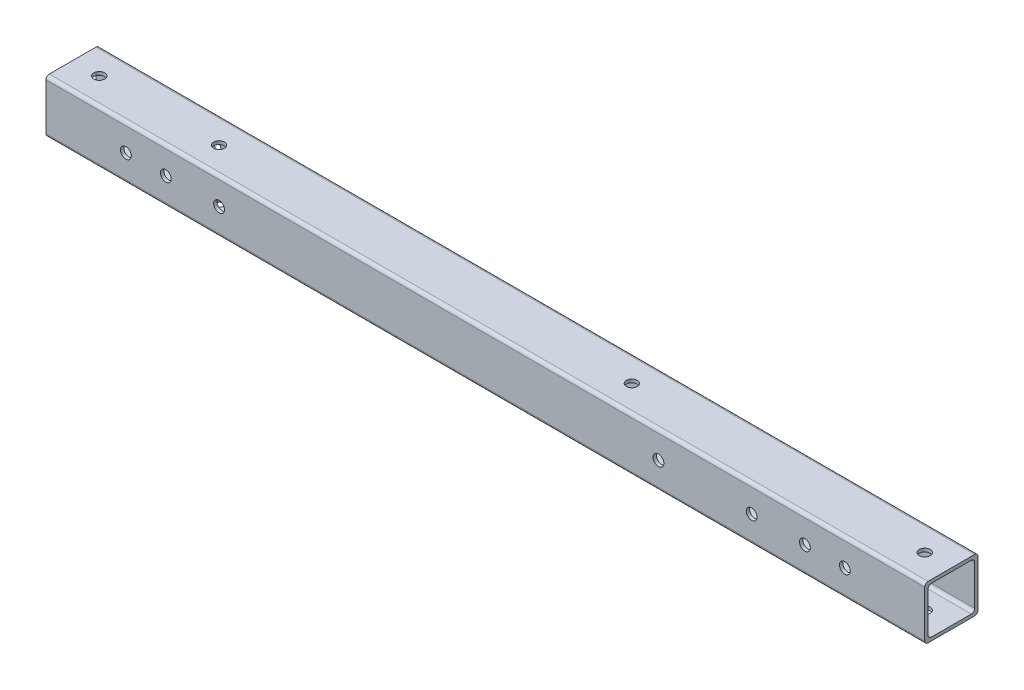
ISO-10303-21;
HEADER;
FILE_DESCRIPTION(('STEP AP214'),'2;1');
FILE_NAME('part.step','',(''),(''),'','','');
FILE_SCHEMA(('AUTOMOTIVE_DESIGN { 1 0 10303 214 1 1 1 1 }'));
ENDSEC;
DATA;
#1=APPLICATION_CONTEXT('core data for automotive mechanical design processes');
#2=APPLICATION_PROTOCOL_DEFINITION('international standard','automotive_design',2000,#1);
#3=PRODUCT_CONTEXT('',#1,'mechanical');
#4=PRODUCT('Part','Part','',(#3));
#5=PRODUCT_RELATED_PRODUCT_CATEGORY('part','',(#4));
#6=PRODUCT_DEFINITION_FORMATION('','',#4);
#7=PRODUCT_DEFINITION_CONTEXT('part definition',#1,'design');
#8=PRODUCT_DEFINITION('design','',#6,#7);
#9=PRODUCT_DEFINITION_SHAPE('','',#8);
#10=(LENGTH_UNIT() NAMED_UNIT(*) SI_UNIT(.MILLI.,.METRE.));
#11=(NAMED_UNIT(*) PLANE_ANGLE_UNIT() SI_UNIT($,.RADIAN.));
#12=(NAMED_UNIT(*) SI_UNIT($,.STERADIAN.) SOLID_ANGLE_UNIT());
#13=UNCERTAINTY_MEASURE_WITH_UNIT(LENGTH_MEASURE(1.E-05),#10,'distance_accuracy_value','');
#14=(GEOMETRIC_REPRESENTATION_CONTEXT(3) GLOBAL_UNCERTAINTY_ASSIGNED_CONTEXT((#13)) GLOBAL_UNIT_ASSIGNED_CONTEXT((#10,
#11,#12)) REPRESENTATION_CONTEXT('',''));
#15=CARTESIAN_POINT('',(0.,0.,0.));
#16=DIRECTION('',(0.,0.,1.));
#17=DIRECTION('',(1.,0.,0.));
#18=AXIS2_PLACEMENT_3D('',#15,#16,#17);
#19=CARTESIAN_POINT('',(0.,101.6,0.));
#20=DIRECTION('',(0.,0.,1.));
#21=DIRECTION('',(1.,0.,0.));
#22=AXIS2_PLACEMENT_3D('',#19,#20,#21);
#23=PLANE('',#22);
#24=CARTESIAN_POINT('',(-508.,50.8,0.));
#25=DIRECTION('',(0.,0.,-1.));
#26=DIRECTION('',(-1.,0.,0.));
#27=AXIS2_PLACEMENT_3D('',#24,#25,#26);
#28=CIRCLE('',#27,10.31875);
#29=CARTESIAN_POINT('',(-518.31875,50.8,0.));
#30=VERTEX_POINT('',#29);
#31=EDGE_CURVE('E237',#30,#30,#28,.T.);
#32=ORIENTED_EDGE('',*,*,#31,.F.);
#33=EDGE_LOOP('',(#32));
#34=FACE_BOUND('',#33,.T.);
#35=CARTESIAN_POINT('',(-228.6,50.8,1.77298507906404E-13));
#36=DIRECTION('',(0.,0.,1.));
#37=DIRECTION('',(1.,0.,0.));
#38=AXIS2_PLACEMENT_3D('',#35,#36,#37);
#39=CIRCLE('',#38,10.31875);
#40=CARTESIAN_POINT('',(-218.28125,50.8,1.78562148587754E-13));
#41=VERTEX_POINT('',#40);
#42=EDGE_CURVE('E260',#41,#41,#39,.T.);
#43=ORIENTED_EDGE('',*,*,#42,.T.);
#44=EDGE_LOOP('',(#43));
#45=FACE_BOUND('',#44,.T.);
#46=CARTESIAN_POINT('',(-152.4,50.8,0.));
#47=DIRECTION('',(0.,0.,-1.));
#48=DIRECTION('',(-1.,0.,0.));
#49=AXIS2_PLACEMENT_3D('',#46,#47,#48);
#50=CIRCLE('',#49,10.31875);
#51=CARTESIAN_POINT('',(-162.71875,50.8,0.));
#52=VERTEX_POINT('',#51);
#53=EDGE_CURVE('E267',#52,#52,#50,.T.);
#54=ORIENTED_EDGE('',*,*,#53,.F.);
#55=EDGE_LOOP('',(#54));
#56=FACE_BOUND('',#55,.T.);
#57=CARTESIAN_POINT('',(-1346.2,50.8,1.64856507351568E-13));
#58=DIRECTION('',(0.,0.,-1.));
#59=DIRECTION('',(-1.,0.,0.));
#60=AXIS2_PLACEMENT_3D('',#57,#58,#59);
#61=CIRCLE('',#60,10.31875);
#62=CARTESIAN_POINT('',(-1356.51875,50.8,1.66120148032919E-13));
#63=VERTEX_POINT('',#62);
#64=EDGE_CURVE('E281',#63,#63,#61,.T.);
#65=ORIENTED_EDGE('',*,*,#64,.F.);
#66=EDGE_LOOP('',(#65));
#67=FACE_BOUND('',#66,.T.);
#68=CARTESIAN_POINT('',(-1447.8,50.8,1.77298507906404E-13));
#69=DIRECTION('',(0.,0.,-1.));
#70=DIRECTION('',(-1.,0.,0.));
#71=AXIS2_PLACEMENT_3D('',#68,#69,#70);
#72=CIRCLE('',#71,10.31875);
#73=CARTESIAN_POINT('',(-1458.11875,50.8,1.78562148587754E-13));
#74=VERTEX_POINT('',#73);
#75=EDGE_CURVE('E288',#74,#74,#72,.T.);
#76=ORIENTED_EDGE('',*,*,#75,.F.);
#77=EDGE_LOOP('',(#76));
#78=FACE_BOUND('',#77,.T.);
#79=DIRECTION('',(0.,-1.,0.));
#80=VECTOR('',#79,1.);
#81=CARTESIAN_POINT('',(-1676.4,101.6,2.05293009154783E-13));
#82=LINE('',#81,#80);
#83=CARTESIAN_POINT('',(-1676.4,95.25,2.05293009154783E-13));
#84=VERTEX_POINT('',#83);
#85=CARTESIAN_POINT('',(-1676.4,6.34999999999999,2.05293009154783E-13));
#86=VERTEX_POINT('',#85);
#87=EDGE_CURVE('E346',#84,#86,#82,.T.);
#88=ORIENTED_EDGE('',*,*,#87,.F.);
#89=DIRECTION('',(-1.,0.,0.));
#90=VECTOR('',#89,1.);
#91=CARTESIAN_POINT('',(0.,95.25,0.));
#92=LINE('',#91,#90);
#93=CARTESIAN_POINT('',(0.,95.25,0.));
#94=VERTEX_POINT('',#93);
#95=EDGE_CURVE('E397',#84,#94,#92,.F.);
#96=ORIENTED_EDGE('',*,*,#95,.T.);
#97=DIRECTION('',(0.,-1.,0.));
#98=VECTOR('',#97,1.);
#99=CARTESIAN_POINT('',(0.,101.6,0.));
#100=LINE('',#99,#98);
#101=CARTESIAN_POINT('',(0.,6.34999999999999,0.));
#102=VERTEX_POINT('',#101);
#103=EDGE_CURVE('E160',#94,#102,#100,.T.);
#104=ORIENTED_EDGE('',*,*,#103,.T.);
#105=DIRECTION('',(-1.,0.,0.));
#106=VECTOR('',#105,1.);
#107=CARTESIAN_POINT('',(-1676.4,6.34999999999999,2.05293009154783E-13));
#108=LINE('',#107,#106);
#109=EDGE_CURVE('E395',#102,#86,#108,.T.);
#110=ORIENTED_EDGE('',*,*,#109,.T.);
#111=EDGE_LOOP('',(#88,#96,#104,#110));
#112=FACE_BOUND('',#111,.T.);
#113=CARTESIAN_POINT('',(-1524.,50.8,0.));
#114=DIRECTION('',(0.,0.,1.));
#115=DIRECTION('',(1.,0.,0.));
#116=AXIS2_PLACEMENT_3D('',#113,#114,#115);
#117=CIRCLE('',#116,10.31875);
#118=CARTESIAN_POINT('',(-1513.68125,50.8,0.));
#119=VERTEX_POINT('',#118);
#120=EDGE_CURVE('E295',#119,#119,#117,.T.);
#121=ORIENTED_EDGE('',*,*,#120,.T.);
#122=EDGE_LOOP('',(#121));
#123=FACE_BOUND('',#122,.T.);
#124=CARTESIAN_POINT('',(-330.2,50.8,1.64856507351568E-13));
#125=DIRECTION('',(0.,0.,1.));
#126=DIRECTION('',(1.,0.,0.));
#127=AXIS2_PLACEMENT_3D('',#124,#125,#126);
#128=CIRCLE('',#127,10.31875);
#129=CARTESIAN_POINT('',(-319.88125,50.8,1.66120148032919E-13));
#130=VERTEX_POINT('',#129);
#131=EDGE_CURVE('E253',#130,#130,#128,.T.);
#132=ORIENTED_EDGE('',*,*,#131,.T.);
#133=EDGE_LOOP('',(#132));
#134=FACE_BOUND('',#133,.T.);
#135=ADVANCED_FACE('F31',(#34,#45,#56,#67,#78,#112,#123,#134),#23,.F.);
#136=CARTESIAN_POINT('',(0.,101.6,101.6));
#137=DIRECTION('',(0.,0.,-1.));
#138=DIRECTION('',(-1.,0.,0.));
#139=AXIS2_PLACEMENT_3D('',#136,#137,#138);
#140=PLANE('',#139);
#141=CARTESIAN_POINT('',(-508.,50.8,101.6));
#142=DIRECTION('',(0.,0.,-1.));
#143=DIRECTION('',(-1.,0.,0.));
#144=AXIS2_PLACEMENT_3D('',#141,#142,#143);
#145=CIRCLE('',#144,10.31875);
#146=CARTESIAN_POINT('',(-518.31875,50.8,101.6));
#147=VERTEX_POINT('',#146);
#148=EDGE_CURVE('E230',#147,#147,#145,.T.);
#149=ORIENTED_EDGE('',*,*,#148,.T.);
#150=EDGE_LOOP('',(#149));
#151=FACE_BOUND('',#150,.T.);
#152=CARTESIAN_POINT('',(-228.6,50.8,101.6));
#153=DIRECTION('',(0.,0.,1.));
#154=DIRECTION('',(1.,0.,0.));
#155=AXIS2_PLACEMENT_3D('',#152,#153,#154);
#156=CIRCLE('',#155,10.31875);
#157=CARTESIAN_POINT('',(-218.28125,50.8,101.6));
#158=VERTEX_POINT('',#157);
#159=EDGE_CURVE('E217',#158,#158,#156,.T.);
#160=ORIENTED_EDGE('',*,*,#159,.F.);
#161=EDGE_LOOP('',(#160));
#162=FACE_BOUND('',#161,.T.);
#163=CARTESIAN_POINT('',(-152.4,50.8,101.6));
#164=DIRECTION('',(0.,0.,-1.));
#165=DIRECTION('',(-1.,0.,0.));
#166=AXIS2_PLACEMENT_3D('',#163,#164,#165);
#167=CIRCLE('',#166,10.31875);
#168=CARTESIAN_POINT('',(-162.71875,50.8,101.6));
#169=VERTEX_POINT('',#168);
#170=EDGE_CURVE('E212',#169,#169,#167,.T.);
#171=ORIENTED_EDGE('',*,*,#170,.T.);
#172=EDGE_LOOP('',(#171));
#173=FACE_BOUND('',#172,.T.);
#174=CARTESIAN_POINT('',(-1346.2,50.8,101.6));
#175=DIRECTION('',(0.,0.,-1.));
#176=DIRECTION('',(-1.,0.,0.));
#177=AXIS2_PLACEMENT_3D('',#174,#175,#176);
#178=CIRCLE('',#177,10.31875);
#179=CARTESIAN_POINT('',(-1356.51875,50.8,101.6));
#180=VERTEX_POINT('',#179);
#181=EDGE_CURVE('E202',#180,#180,#178,.T.);
#182=ORIENTED_EDGE('',*,*,#181,.T.);
#183=EDGE_LOOP('',(#182));
#184=FACE_BOUND('',#183,.T.);
#185=CARTESIAN_POINT('',(-1447.8,50.8,101.6));
#186=DIRECTION('',(0.,0.,-1.));
#187=DIRECTION('',(-1.,0.,0.));
#188=AXIS2_PLACEMENT_3D('',#185,#186,#187);
#189=CIRCLE('',#188,10.31875);
#190=CARTESIAN_POINT('',(-1458.11875,50.8,101.6));
#191=VERTEX_POINT('',#190);
#192=EDGE_CURVE('E197',#191,#191,#189,.T.);
#193=ORIENTED_EDGE('',*,*,#192,.T.);
#194=EDGE_LOOP('',(#193));
#195=FACE_BOUND('',#194,.T.);
#196=DIRECTION('',(0.,-1.,0.));
#197=VECTOR('',#196,1.);
#198=CARTESIAN_POINT('',(-1676.4,101.6,101.6));
#199=LINE('',#198,#197);
#200=CARTESIAN_POINT('',(-1676.4,95.25,101.6));
#201=VERTEX_POINT('',#200);
#202=CARTESIAN_POINT('',(-1676.4,6.34999999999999,101.6));
#203=VERTEX_POINT('',#202);
#204=EDGE_CURVE('E343',#201,#203,#199,.T.);
#205=ORIENTED_EDGE('',*,*,#204,.T.);
#206=DIRECTION('',(1.,0.,0.));
#207=VECTOR('',#206,1.);
#208=CARTESIAN_POINT('',(0.,6.34999999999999,101.6));
#209=LINE('',#208,#207);
#210=CARTESIAN_POINT('',(0.,6.34999999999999,101.6));
#211=VERTEX_POINT('',#210);
#212=EDGE_CURVE('E360',#203,#211,#209,.T.);
#213=ORIENTED_EDGE('',*,*,#212,.T.);
#214=DIRECTION('',(0.,-1.,0.));
#215=VECTOR('',#214,1.);
#216=CARTESIAN_POINT('',(0.,101.6,101.6));
#217=LINE('',#216,#215);
#218=CARTESIAN_POINT('',(0.,95.25,101.6));
#219=VERTEX_POINT('',#218);
#220=EDGE_CURVE('E336',#219,#211,#217,.T.);
#221=ORIENTED_EDGE('',*,*,#220,.F.);
#222=DIRECTION('',(1.,0.,0.));
#223=VECTOR('',#222,1.);
#224=CARTESIAN_POINT('',(0.,95.25,101.6));
#225=LINE('',#224,#223);
#226=EDGE_CURVE('E358',#219,#201,#225,.F.);
#227=ORIENTED_EDGE('',*,*,#226,.T.);
#228=EDGE_LOOP('',(#205,#213,#221,#227));
#229=FACE_BOUND('',#228,.T.);
#230=CARTESIAN_POINT('',(-1524.,50.8,101.6));
#231=DIRECTION('',(0.,0.,1.));
#232=DIRECTION('',(1.,0.,0.));
#233=AXIS2_PLACEMENT_3D('',#230,#231,#232);
#234=CIRCLE('',#233,10.31875);
#235=CARTESIAN_POINT('',(-1513.68125,50.8,101.6));
#236=VERTEX_POINT('',#235);
#237=EDGE_CURVE('E192',#236,#236,#234,.T.);
#238=ORIENTED_EDGE('',*,*,#237,.F.);
#239=EDGE_LOOP('',(#238));
#240=FACE_BOUND('',#239,.T.);
#241=CARTESIAN_POINT('',(-330.2,50.8,101.6));
#242=DIRECTION('',(0.,0.,1.));
#243=DIRECTION('',(1.,0.,0.));
#244=AXIS2_PLACEMENT_3D('',#241,#242,#243);
#245=CIRCLE('',#244,10.31875);
#246=CARTESIAN_POINT('',(-319.88125,50.8,101.6));
#247=VERTEX_POINT('',#246);
#248=EDGE_CURVE('E222',#247,#247,#245,.T.);
#249=ORIENTED_EDGE('',*,*,#248,.F.);
#250=EDGE_LOOP('',(#249));
#251=FACE_BOUND('',#250,.T.);
#252=ADVANCED_FACE('F426',(#151,#162,#173,#184,#195,#229,#240,#251),#140,.F.);
#253=CARTESIAN_POINT('',(0.000999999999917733,95.25,6.35000000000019));
#254=DIRECTION('',(0.,0.,-1.));
#255=DIRECTION('',(0.,1.,0.));
#256=AXIS2_PLACEMENT_3D('',#253,#254,#255);
#257=PLANE('',#256);
#258=CARTESIAN_POINT('',(-508.,50.8,6.3500000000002));
#259=DIRECTION('',(0.,0.,-1.));
#260=DIRECTION('',(0.,1.,0.));
#261=AXIS2_PLACEMENT_3D('',#258,#259,#260);
#262=CIRCLE('',#261,10.31875);
#263=CARTESIAN_POINT('',(-508.,61.11875,6.3500000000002));
#264=VERTEX_POINT('',#263);
#265=EDGE_CURVE('E229',#264,#264,#262,.T.);
#266=ORIENTED_EDGE('',*,*,#265,.T.);
#267=EDGE_LOOP('',(#266));
#268=FACE_BOUND('',#267,.T.);
#269=CARTESIAN_POINT('',(-228.6,50.8,6.3500000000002));
#270=DIRECTION('',(0.,0.,-1.));
#271=DIRECTION('',(0.,1.,0.));
#272=AXIS2_PLACEMENT_3D('',#269,#270,#271);
#273=CIRCLE('',#272,10.31875);
#274=CARTESIAN_POINT('',(-228.6,61.11875,6.3500000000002));
#275=VERTEX_POINT('',#274);
#276=EDGE_CURVE('E216',#275,#275,#273,.F.);
#277=ORIENTED_EDGE('',*,*,#276,.F.);
#278=EDGE_LOOP('',(#277));
#279=FACE_BOUND('',#278,.T.);
#280=CARTESIAN_POINT('',(-152.4,50.8,6.3500000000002));
#281=DIRECTION('',(0.,0.,-1.));
#282=DIRECTION('',(0.,1.,0.));
#283=AXIS2_PLACEMENT_3D('',#280,#281,#282);
#284=CIRCLE('',#283,10.31875);
#285=CARTESIAN_POINT('',(-152.4,61.11875,6.3500000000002));
#286=VERTEX_POINT('',#285);
#287=EDGE_CURVE('E211',#286,#286,#284,.T.);
#288=ORIENTED_EDGE('',*,*,#287,.T.);
#289=EDGE_LOOP('',(#288));
#290=FACE_BOUND('',#289,.T.);
#291=CARTESIAN_POINT('',(-1346.2,50.8,6.3500000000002));
#292=DIRECTION('',(0.,0.,-1.));
#293=DIRECTION('',(0.,1.,0.));
#294=AXIS2_PLACEMENT_3D('',#291,#292,#293);
#295=CIRCLE('',#294,10.31875);
#296=CARTESIAN_POINT('',(-1346.2,61.11875,6.3500000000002));
#297=VERTEX_POINT('',#296);
#298=EDGE_CURVE('E201',#297,#297,#295,.T.);
#299=ORIENTED_EDGE('',*,*,#298,.T.);
#300=EDGE_LOOP('',(#299));
#301=FACE_BOUND('',#300,.T.);
#302=CARTESIAN_POINT('',(-1447.8,50.8,6.3500000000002));
#303=DIRECTION('',(0.,0.,-1.));
#304=DIRECTION('',(0.,1.,0.));
#305=AXIS2_PLACEMENT_3D('',#302,#303,#304);
#306=CIRCLE('',#305,10.31875);
#307=CARTESIAN_POINT('',(-1447.8,61.11875,6.3500000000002));
#308=VERTEX_POINT('',#307);
#309=EDGE_CURVE('E196',#308,#308,#306,.T.);
#310=ORIENTED_EDGE('',*,*,#309,.T.);
#311=EDGE_LOOP('',(#310));
#312=FACE_BOUND('',#311,.T.);
#313=DIRECTION('',(0.,1.,0.));
#314=VECTOR('',#313,1.);
#315=CARTESIAN_POINT('',(0.,95.25,6.35000000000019));
#316=LINE('',#315,#314);
#317=CARTESIAN_POINT('',(0.,12.7,6.3500000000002));
#318=VERTEX_POINT('',#317);
#319=CARTESIAN_POINT('',(0.,88.9,6.35000000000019));
#320=VERTEX_POINT('',#319);
#321=EDGE_CURVE('E312',#318,#320,#316,.T.);
#322=ORIENTED_EDGE('',*,*,#321,.T.);
#323=DIRECTION('',(-1.,0.,0.));
#324=VECTOR('',#323,1.);
#325=CARTESIAN_POINT('',(-1676.4,88.9,6.35000000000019));
#326=LINE('',#325,#324);
#327=CARTESIAN_POINT('',(-1676.4,88.9,6.35000000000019));
#328=VERTEX_POINT('',#327);
#329=EDGE_CURVE('E392',#320,#328,#326,.T.);
#330=ORIENTED_EDGE('',*,*,#329,.T.);
#331=DIRECTION('',(0.,-1.,0.));
#332=VECTOR('',#331,1.);
#333=CARTESIAN_POINT('',(-1676.4,95.25,6.35000000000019));
#334=LINE('',#333,#332);
#335=CARTESIAN_POINT('',(-1676.4,12.7,6.3500000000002));
#336=VERTEX_POINT('',#335);
#337=EDGE_CURVE('E315',#328,#336,#334,.T.);
#338=ORIENTED_EDGE('',*,*,#337,.T.);
#339=DIRECTION('',(-1.,0.,0.));
#340=VECTOR('',#339,1.);
#341=CARTESIAN_POINT('',(0.,12.7,6.3500000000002));
#342=LINE('',#341,#340);
#343=EDGE_CURVE('E390',#336,#318,#342,.F.);
#344=ORIENTED_EDGE('',*,*,#343,.T.);
#345=EDGE_LOOP('',(#322,#330,#338,#344));
#346=FACE_BOUND('',#345,.T.);
#347=CARTESIAN_POINT('',(-1524.,50.8,6.3500000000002));
#348=DIRECTION('',(0.,0.,-1.));
#349=DIRECTION('',(0.,1.,0.));
#350=AXIS2_PLACEMENT_3D('',#347,#348,#349);
#351=CIRCLE('',#350,10.31875);
#352=CARTESIAN_POINT('',(-1524.,61.11875,6.3500000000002));
#353=VERTEX_POINT('',#352);
#354=EDGE_CURVE('E191',#353,#353,#351,.F.);
#355=ORIENTED_EDGE('',*,*,#354,.F.);
#356=EDGE_LOOP('',(#355));
#357=FACE_BOUND('',#356,.T.);
#358=CARTESIAN_POINT('',(-330.2,50.8,6.3500000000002));
#359=DIRECTION('',(0.,0.,-1.));
#360=DIRECTION('',(0.,1.,0.));
#361=AXIS2_PLACEMENT_3D('',#358,#359,#360);
#362=CIRCLE('',#361,10.31875);
#363=CARTESIAN_POINT('',(-330.2,61.11875,6.3500000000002));
#364=VERTEX_POINT('',#363);
#365=EDGE_CURVE('E221',#364,#364,#362,.F.);
#366=ORIENTED_EDGE('',*,*,#365,.F.);
#367=EDGE_LOOP('',(#366));
#368=FACE_BOUND('',#367,.T.);
#369=ADVANCED_FACE('F432',(#268,#279,#290,#301,#312,#346,#357,#368),#257,.F.);
#370=CARTESIAN_POINT('',(0.000999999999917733,95.25,95.2500000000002));
#371=DIRECTION('',(0.,0.,1.));
#372=DIRECTION('',(0.,-1.,0.));
#373=AXIS2_PLACEMENT_3D('',#370,#371,#372);
#374=PLANE('',#373);
#375=CARTESIAN_POINT('',(-508.,50.8,95.2500000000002));
#376=DIRECTION('',(0.,0.,1.));
#377=DIRECTION('',(0.,-1.,0.));
#378=AXIS2_PLACEMENT_3D('',#375,#376,#377);
#379=CIRCLE('',#378,10.31875);
#380=CARTESIAN_POINT('',(-508.,40.48125,95.2500000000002));
#381=VERTEX_POINT('',#380);
#382=EDGE_CURVE('E227',#381,#381,#379,.T.);
#383=ORIENTED_EDGE('',*,*,#382,.T.);
#384=EDGE_LOOP('',(#383));
#385=FACE_BOUND('',#384,.T.);
#386=CARTESIAN_POINT('',(-228.6,50.8,95.2500000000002));
#387=DIRECTION('',(0.,0.,1.));
#388=DIRECTION('',(0.,-1.,0.));
#389=AXIS2_PLACEMENT_3D('',#386,#387,#388);
#390=CIRCLE('',#389,10.31875);
#391=CARTESIAN_POINT('',(-228.6,40.48125,95.2500000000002));
#392=VERTEX_POINT('',#391);
#393=EDGE_CURVE('E213',#392,#392,#390,.F.);
#394=ORIENTED_EDGE('',*,*,#393,.F.);
#395=EDGE_LOOP('',(#394));
#396=FACE_BOUND('',#395,.T.);
#397=CARTESIAN_POINT('',(-152.4,50.8,95.2500000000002));
#398=DIRECTION('',(0.,0.,1.));
#399=DIRECTION('',(0.,-1.,0.));
#400=AXIS2_PLACEMENT_3D('',#397,#398,#399);
#401=CIRCLE('',#400,10.31875);
#402=CARTESIAN_POINT('',(-152.4,40.48125,95.2500000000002));
#403=VERTEX_POINT('',#402);
#404=EDGE_CURVE('E208',#403,#403,#401,.T.);
#405=ORIENTED_EDGE('',*,*,#404,.T.);
#406=EDGE_LOOP('',(#405));
#407=FACE_BOUND('',#406,.T.);
#408=CARTESIAN_POINT('',(-1346.2,50.8,95.2500000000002));
#409=DIRECTION('',(0.,0.,1.));
#410=DIRECTION('',(0.,-1.,0.));
#411=AXIS2_PLACEMENT_3D('',#408,#409,#410);
#412=CIRCLE('',#411,10.31875);
#413=CARTESIAN_POINT('',(-1346.2,40.48125,95.2500000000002));
#414=VERTEX_POINT('',#413);
#415=EDGE_CURVE('E198',#414,#414,#412,.T.);
#416=ORIENTED_EDGE('',*,*,#415,.T.);
#417=EDGE_LOOP('',(#416));
#418=FACE_BOUND('',#417,.T.);
#419=CARTESIAN_POINT('',(-1447.8,50.8,95.2500000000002));
#420=DIRECTION('',(0.,0.,1.));
#421=DIRECTION('',(0.,-1.,0.));
#422=AXIS2_PLACEMENT_3D('',#419,#420,#421);
#423=CIRCLE('',#422,10.31875);
#424=CARTESIAN_POINT('',(-1447.8,40.48125,95.2500000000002));
#425=VERTEX_POINT('',#424);
#426=EDGE_CURVE('E193',#425,#425,#423,.T.);
#427=ORIENTED_EDGE('',*,*,#426,.T.);
#428=EDGE_LOOP('',(#427));
#429=FACE_BOUND('',#428,.T.);
#430=DIRECTION('',(0.,-1.,0.));
#431=VECTOR('',#430,1.);
#432=CARTESIAN_POINT('',(0.,95.25,95.2500000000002));
#433=LINE('',#432,#431);
#434=CARTESIAN_POINT('',(0.,88.9,95.2500000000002));
#435=VERTEX_POINT('',#434);
#436=CARTESIAN_POINT('',(0.,12.7,95.2500000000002));
#437=VERTEX_POINT('',#436);
#438=EDGE_CURVE('E153',#435,#437,#433,.T.);
#439=ORIENTED_EDGE('',*,*,#438,.T.);
#440=DIRECTION('',(-1.,0.,0.));
#441=VECTOR('',#440,1.);
#442=CARTESIAN_POINT('',(-1676.4,12.7,95.2500000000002));
#443=LINE('',#442,#441);
#444=CARTESIAN_POINT('',(-1676.4,12.7,95.2500000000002));
#445=VERTEX_POINT('',#444);
#446=EDGE_CURVE('E159',#437,#445,#443,.T.);
#447=ORIENTED_EDGE('',*,*,#446,.T.);
#448=DIRECTION('',(0.,1.,0.));
#449=VECTOR('',#448,1.);
#450=CARTESIAN_POINT('',(-1676.4,95.25,95.2500000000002));
#451=LINE('',#450,#449);
#452=CARTESIAN_POINT('',(-1676.4,88.9,95.2500000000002));
#453=VERTEX_POINT('',#452);
#454=EDGE_CURVE('E156',#445,#453,#451,.T.);
#455=ORIENTED_EDGE('',*,*,#454,.T.);
#456=DIRECTION('',(-1.,0.,0.));
#457=VECTOR('',#456,1.);
#458=CARTESIAN_POINT('',(0.,88.9,95.2500000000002));
#459=LINE('',#458,#457);
#460=EDGE_CURVE('E148',#453,#435,#459,.F.);
#461=ORIENTED_EDGE('',*,*,#460,.T.);
#462=EDGE_LOOP('',(#439,#447,#455,#461));
#463=FACE_BOUND('',#462,.T.);
#464=CARTESIAN_POINT('',(-1524.,50.8,95.2500000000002));
#465=DIRECTION('',(0.,0.,1.));
#466=DIRECTION('',(0.,-1.,0.));
#467=AXIS2_PLACEMENT_3D('',#464,#465,#466);
#468=CIRCLE('',#467,10.31875);
#469=CARTESIAN_POINT('',(-1524.,40.48125,95.2500000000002));
#470=VERTEX_POINT('',#469);
#471=EDGE_CURVE('E188',#470,#470,#468,.F.);
#472=ORIENTED_EDGE('',*,*,#471,.F.);
#473=EDGE_LOOP('',(#472));
#474=FACE_BOUND('',#473,.T.);
#475=CARTESIAN_POINT('',(-330.2,50.8,95.2500000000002));
#476=DIRECTION('',(0.,0.,1.));
#477=DIRECTION('',(0.,-1.,0.));
#478=AXIS2_PLACEMENT_3D('',#475,#476,#477);
#479=CIRCLE('',#478,10.31875);
#480=CARTESIAN_POINT('',(-330.2,40.48125,95.2500000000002));
#481=VERTEX_POINT('',#480);
#482=EDGE_CURVE('E218',#481,#481,#479,.F.);
#483=ORIENTED_EDGE('',*,*,#482,.F.);
#484=EDGE_LOOP('',(#483));
#485=FACE_BOUND('',#484,.T.);
#486=ADVANCED_FACE('F150',(#385,#396,#407,#418,#429,#463,#474,#485),#374,.F.);
#487=CARTESIAN_POINT('',(0.,101.6,0.));
#488=DIRECTION('',(0.,-1.,0.));
#489=DIRECTION('',(0.,0.,-1.));
#490=AXIS2_PLACEMENT_3D('',#487,#488,#489);
#491=PLANE('',#490);
#492=CARTESIAN_POINT('',(-1397.,101.6,50.8000000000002));
#493=DIRECTION('',(0.,1.,0.));
#494=DIRECTION('',(0.,0.,1.));
#495=AXIS2_PLACEMENT_3D('',#492,#493,#494);
#496=CIRCLE('',#495,10.31875);
#497=CARTESIAN_POINT('',(-1397.,101.6,61.1187500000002));
#498=VERTEX_POINT('',#497);
#499=EDGE_CURVE('E790',#498,#498,#496,.T.);
#500=ORIENTED_EDGE('',*,*,#499,.F.);
#501=EDGE_LOOP('',(#500));
#502=FACE_BOUND('',#501,.T.);
#503=CARTESIAN_POINT('',(-609.6,101.6,50.8000000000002));
#504=DIRECTION('',(0.,1.,0.));
#505=DIRECTION('',(0.,0.,1.));
#506=AXIS2_PLACEMENT_3D('',#503,#504,#505);
#507=CIRCLE('',#506,10.31875);
#508=CARTESIAN_POINT('',(-609.6,101.6,61.1187500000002));
#509=VERTEX_POINT('',#508);
#510=EDGE_CURVE('E234',#509,#509,#507,.T.);
#511=ORIENTED_EDGE('',*,*,#510,.F.);
#512=EDGE_LOOP('',(#511));
#513=FACE_BOUND('',#512,.T.);
#514=DIRECTION('',(0.,0.,1.));
#515=VECTOR('',#514,1.);
#516=CARTESIAN_POINT('',(-1676.4,101.6,2.05293009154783E-13));
#517=LINE('',#516,#515);
#518=CARTESIAN_POINT('',(-1676.4,101.6,6.3500000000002));
#519=VERTEX_POINT('',#518);
#520=CARTESIAN_POINT('',(-1676.4,101.6,95.2500000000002));
#521=VERTEX_POINT('',#520);
#522=EDGE_CURVE('E332',#519,#521,#517,.T.);
#523=ORIENTED_EDGE('',*,*,#522,.T.);
#524=DIRECTION('',(1.,0.,0.));
#525=VECTOR('',#524,1.);
#526=CARTESIAN_POINT('',(0.,101.6,95.25));
#527=LINE('',#526,#525);
#528=CARTESIAN_POINT('',(0.,101.6,95.25));
#529=VERTEX_POINT('',#528);
#530=EDGE_CURVE('E384',#521,#529,#527,.T.);
#531=ORIENTED_EDGE('',*,*,#530,.T.);
#532=DIRECTION('',(0.,0.,-1.));
#533=VECTOR('',#532,1.);
#534=CARTESIAN_POINT('',(0.,101.6,0.));
#535=LINE('',#534,#533);
#536=CARTESIAN_POINT('',(0.,101.6,6.35));
#537=VERTEX_POINT('',#536);
#538=EDGE_CURVE('E329',#529,#537,#535,.T.);
#539=ORIENTED_EDGE('',*,*,#538,.T.);
#540=DIRECTION('',(-1.,0.,0.));
#541=VECTOR('',#540,1.);
#542=CARTESIAN_POINT('',(0.,101.6,6.35));
#543=LINE('',#542,#541);
#544=EDGE_CURVE('E381',#537,#519,#543,.T.);
#545=ORIENTED_EDGE('',*,*,#544,.T.);
#546=EDGE_LOOP('',(#523,#531,#539,#545));
#547=FACE_BOUND('',#546,.T.);
#548=CARTESIAN_POINT('',(-1625.6,101.6,50.8000000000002));
#549=DIRECTION('',(0.,1.,0.));
#550=DIRECTION('',(0.,0.,1.));
#551=AXIS2_PLACEMENT_3D('',#548,#549,#550);
#552=CIRCLE('',#551,10.31875);
#553=CARTESIAN_POINT('',(-1625.6,101.6,61.1187500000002));
#554=VERTEX_POINT('',#553);
#555=EDGE_CURVE('E302',#554,#554,#552,.T.);
#556=ORIENTED_EDGE('',*,*,#555,.F.);
#557=EDGE_LOOP('',(#556));
#558=FACE_BOUND('',#557,.T.);
#559=CARTESIAN_POINT('',(-50.8,101.6,50.8000000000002));
#560=DIRECTION('',(0.,-1.,0.));
#561=DIRECTION('',(0.,0.,1.));
#562=AXIS2_PLACEMENT_3D('',#559,#560,#561);
#563=CIRCLE('',#562,10.31875);
#564=CARTESIAN_POINT('',(-50.8,101.6,61.1187500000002));
#565=VERTEX_POINT('',#564);
#566=EDGE_CURVE('E274',#565,#565,#563,.T.);
#567=ORIENTED_EDGE('',*,*,#566,.T.);
#568=EDGE_LOOP('',(#567));
#569=FACE_BOUND('',#568,.T.);
#570=ADVANCED_FACE('F458',(#502,#513,#547,#558,#569),#491,.F.);
#571=CARTESIAN_POINT('',(0.,0.,0.));
#572=DIRECTION('',(0.,-1.,0.));
#573=DIRECTION('',(0.,0.,-1.));
#574=AXIS2_PLACEMENT_3D('',#571,#572,#573);
#575=PLANE('',#574);
#576=CARTESIAN_POINT('',(-1397.,0.,50.8000000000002));
#577=DIRECTION('',(0.,1.,0.));
#578=DIRECTION('',(0.,0.,1.));
#579=AXIS2_PLACEMENT_3D('',#576,#577,#578);
#580=CIRCLE('',#579,10.31875);
#581=CARTESIAN_POINT('',(-1397.,0.,61.1187500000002));
#582=VERTEX_POINT('',#581);
#583=EDGE_CURVE('E469',#582,#582,#580,.T.);
#584=ORIENTED_EDGE('',*,*,#583,.T.);
#585=EDGE_LOOP('',(#584));
#586=FACE_BOUND('',#585,.T.);
#587=CARTESIAN_POINT('',(-609.6,0.,50.8000000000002));
#588=DIRECTION('',(0.,1.,0.));
#589=DIRECTION('',(0.,0.,1.));
#590=AXIS2_PLACEMENT_3D('',#587,#588,#589);
#591=CIRCLE('',#590,10.31875);
#592=CARTESIAN_POINT('',(-609.6,0.,61.1187500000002));
#593=VERTEX_POINT('',#592);
#594=EDGE_CURVE('E226',#593,#593,#591,.T.);
#595=ORIENTED_EDGE('',*,*,#594,.T.);
#596=EDGE_LOOP('',(#595));
#597=FACE_BOUND('',#596,.T.);
#598=DIRECTION('',(0.,0.,-1.));
#599=VECTOR('',#598,1.);
#600=CARTESIAN_POINT('',(0.,0.,0.));
#601=LINE('',#600,#599);
#602=CARTESIAN_POINT('',(0.,0.,95.25));
#603=VERTEX_POINT('',#602);
#604=CARTESIAN_POINT('',(0.,0.,6.35));
#605=VERTEX_POINT('',#604);
#606=EDGE_CURVE('E328',#603,#605,#601,.T.);
#607=ORIENTED_EDGE('',*,*,#606,.F.);
#608=DIRECTION('',(1.,0.,0.));
#609=VECTOR('',#608,1.);
#610=CARTESIAN_POINT('',(-1676.4,0.,95.2500000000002));
#611=LINE('',#610,#609);
#612=CARTESIAN_POINT('',(-1676.4,0.,95.2500000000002));
#613=VERTEX_POINT('',#612);
#614=EDGE_CURVE('E373',#603,#613,#611,.F.);
#615=ORIENTED_EDGE('',*,*,#614,.T.);
#616=DIRECTION('',(0.,0.,1.));
#617=VECTOR('',#616,1.);
#618=CARTESIAN_POINT('',(-1676.4,0.,2.05293009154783E-13));
#619=LINE('',#618,#617);
#620=CARTESIAN_POINT('',(-1676.4,0.,6.3500000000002));
#621=VERTEX_POINT('',#620);
#622=EDGE_CURVE('E333',#621,#613,#619,.T.);
#623=ORIENTED_EDGE('',*,*,#622,.F.);
#624=DIRECTION('',(-1.,0.,0.));
#625=VECTOR('',#624,1.);
#626=CARTESIAN_POINT('',(0.,0.,6.35));
#627=LINE('',#626,#625);
#628=EDGE_CURVE('E371',#621,#605,#627,.F.);
#629=ORIENTED_EDGE('',*,*,#628,.T.);
#630=EDGE_LOOP('',(#607,#615,#623,#629));
#631=FACE_BOUND('',#630,.T.);
#632=CARTESIAN_POINT('',(-1625.6,0.,50.8000000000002));
#633=DIRECTION('',(0.,1.,0.));
#634=DIRECTION('',(0.,0.,1.));
#635=AXIS2_PLACEMENT_3D('',#632,#633,#634);
#636=CIRCLE('',#635,10.31875);
#637=CARTESIAN_POINT('',(-1625.6,0.,61.1187500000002));
#638=VERTEX_POINT('',#637);
#639=EDGE_CURVE('E303',#638,#638,#636,.T.);
#640=ORIENTED_EDGE('',*,*,#639,.T.);
#641=EDGE_LOOP('',(#640));
#642=FACE_BOUND('',#641,.T.);
#643=CARTESIAN_POINT('',(-50.8,0.,50.8000000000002));
#644=DIRECTION('',(0.,-1.,0.));
#645=DIRECTION('',(0.,0.,1.));
#646=AXIS2_PLACEMENT_3D('',#643,#644,#645);
#647=CIRCLE('',#646,10.31875);
#648=CARTESIAN_POINT('',(-50.8,0.,61.1187500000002));
#649=VERTEX_POINT('',#648);
#650=EDGE_CURVE('E207',#649,#649,#647,.T.);
#651=ORIENTED_EDGE('',*,*,#650,.F.);
#652=EDGE_LOOP('',(#651));
#653=FACE_BOUND('',#652,.T.);
#654=ADVANCED_FACE('F448',(#586,#597,#631,#642,#653),#575,.T.);
#655=CARTESIAN_POINT('',(0.000999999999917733,95.25,6.35000000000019));
#656=DIRECTION('',(0.,1.,0.));
#657=DIRECTION('',(0.,0.,1.));
#658=AXIS2_PLACEMENT_3D('',#655,#656,#657);
#659=PLANE('',#658);
#660=CARTESIAN_POINT('',(-1397.,95.25,50.8000000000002));
#661=DIRECTION('',(0.,1.,0.));
#662=DIRECTION('',(0.,0.,1.));
#663=AXIS2_PLACEMENT_3D('',#660,#661,#662);
#664=CIRCLE('',#663,10.31875);
#665=CARTESIAN_POINT('',(-1397.,95.25,61.1187500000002));
#666=VERTEX_POINT('',#665);
#667=EDGE_CURVE('E242',#666,#666,#664,.T.);
#668=ORIENTED_EDGE('',*,*,#667,.T.);
#669=EDGE_LOOP('',(#668));
#670=FACE_BOUND('',#669,.T.);
#671=CARTESIAN_POINT('',(-609.6,95.25,50.8000000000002));
#672=DIRECTION('',(0.,1.,0.));
#673=DIRECTION('',(0.,0.,1.));
#674=AXIS2_PLACEMENT_3D('',#671,#672,#673);
#675=CIRCLE('',#674,10.31875);
#676=CARTESIAN_POINT('',(-609.6,95.25,61.1187500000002));
#677=VERTEX_POINT('',#676);
#678=EDGE_CURVE('E225',#677,#677,#675,.T.);
#679=ORIENTED_EDGE('',*,*,#678,.T.);
#680=EDGE_LOOP('',(#679));
#681=FACE_BOUND('',#680,.T.);
#682=DIRECTION('',(0.,0.,1.));
#683=VECTOR('',#682,1.);
#684=CARTESIAN_POINT('',(0.,95.25,6.35000000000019));
#685=LINE('',#684,#683);
#686=CARTESIAN_POINT('',(0.,95.25,12.7000000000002));
#687=VERTEX_POINT('',#686);
#688=CARTESIAN_POINT('',(0.,95.25,88.9000000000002));
#689=VERTEX_POINT('',#688);
#690=EDGE_CURVE('E171',#687,#689,#685,.T.);
#691=ORIENTED_EDGE('',*,*,#690,.T.);
#692=DIRECTION('',(-1.,0.,0.));
#693=VECTOR('',#692,1.);
#694=CARTESIAN_POINT('',(-1676.4,95.25,88.9000000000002));
#695=LINE('',#694,#693);
#696=CARTESIAN_POINT('',(-1676.4,95.25,88.9000000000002));
#697=VERTEX_POINT('',#696);
#698=EDGE_CURVE('E177',#689,#697,#695,.T.);
#699=ORIENTED_EDGE('',*,*,#698,.T.);
#700=DIRECTION('',(0.,0.,-1.));
#701=VECTOR('',#700,1.);
#702=CARTESIAN_POINT('',(-1676.4,95.25,6.35000000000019));
#703=LINE('',#702,#701);
#704=CARTESIAN_POINT('',(-1676.4,95.25,12.7000000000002));
#705=VERTEX_POINT('',#704);
#706=EDGE_CURVE('E322',#697,#705,#703,.T.);
#707=ORIENTED_EDGE('',*,*,#706,.T.);
#708=DIRECTION('',(-1.,0.,0.));
#709=VECTOR('',#708,1.);
#710=CARTESIAN_POINT('',(0.,95.25,12.7000000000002));
#711=LINE('',#710,#709);
#712=EDGE_CURVE('E387',#705,#687,#711,.F.);
#713=ORIENTED_EDGE('',*,*,#712,.T.);
#714=EDGE_LOOP('',(#691,#699,#707,#713));
#715=FACE_BOUND('',#714,.T.);
#716=CARTESIAN_POINT('',(-1625.6,95.25,50.8000000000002));
#717=DIRECTION('',(0.,1.,0.));
#718=DIRECTION('',(0.,0.,1.));
#719=AXIS2_PLACEMENT_3D('',#716,#717,#718);
#720=CIRCLE('',#719,10.31875);
#721=CARTESIAN_POINT('',(-1625.6,95.25,61.1187500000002));
#722=VERTEX_POINT('',#721);
#723=EDGE_CURVE('E172',#722,#722,#720,.T.);
#724=ORIENTED_EDGE('',*,*,#723,.T.);
#725=EDGE_LOOP('',(#724));
#726=FACE_BOUND('',#725,.T.);
#727=CARTESIAN_POINT('',(-50.8,95.25,50.8000000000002));
#728=DIRECTION('',(0.,1.,0.));
#729=DIRECTION('',(0.,0.,1.));
#730=AXIS2_PLACEMENT_3D('',#727,#728,#729);
#731=CIRCLE('',#730,10.31875);
#732=CARTESIAN_POINT('',(-50.8,95.25,61.1187500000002));
#733=VERTEX_POINT('',#732);
#734=EDGE_CURVE('E206',#733,#733,#731,.F.);
#735=ORIENTED_EDGE('',*,*,#734,.F.);
#736=EDGE_LOOP('',(#735));
#737=FACE_BOUND('',#736,.T.);
#738=ADVANCED_FACE('F442',(#670,#681,#715,#726,#737),#659,.F.);
#739=CARTESIAN_POINT('',(0.000999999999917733,6.35,6.35000000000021));
#740=DIRECTION('',(0.,-1.,0.));
#741=DIRECTION('',(0.,0.,-1.));
#742=AXIS2_PLACEMENT_3D('',#739,#740,#741);
#743=PLANE('',#742);
#744=CARTESIAN_POINT('',(-1397.,6.35,50.8000000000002));
#745=DIRECTION('',(0.,-1.,0.));
#746=DIRECTION('',(0.,0.,-1.));
#747=AXIS2_PLACEMENT_3D('',#744,#745,#746);
#748=CIRCLE('',#747,10.31875);
#749=CARTESIAN_POINT('',(-1397.,6.35,40.4812500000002));
#750=VERTEX_POINT('',#749);
#751=EDGE_CURVE('E35',#750,#750,#748,.T.);
#752=ORIENTED_EDGE('',*,*,#751,.T.);
#753=EDGE_LOOP('',(#752));
#754=FACE_BOUND('',#753,.T.);
#755=CARTESIAN_POINT('',(-609.6,6.35,50.8000000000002));
#756=DIRECTION('',(0.,-1.,0.));
#757=DIRECTION('',(0.,0.,-1.));
#758=AXIS2_PLACEMENT_3D('',#755,#756,#757);
#759=CIRCLE('',#758,10.31875);
#760=CARTESIAN_POINT('',(-609.6,6.35,40.4812500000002));
#761=VERTEX_POINT('',#760);
#762=EDGE_CURVE('E223',#761,#761,#759,.T.);
#763=ORIENTED_EDGE('',*,*,#762,.T.);
#764=EDGE_LOOP('',(#763));
#765=FACE_BOUND('',#764,.T.);
#766=DIRECTION('',(0.,0.,1.));
#767=VECTOR('',#766,1.);
#768=CARTESIAN_POINT('',(-1676.4,6.35,6.35000000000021));
#769=LINE('',#768,#767);
#770=CARTESIAN_POINT('',(-1676.4,6.35,12.7000000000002));
#771=VERTEX_POINT('',#770);
#772=CARTESIAN_POINT('',(-1676.4,6.35,88.9000000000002));
#773=VERTEX_POINT('',#772);
#774=EDGE_CURVE('E318',#771,#773,#769,.T.);
#775=ORIENTED_EDGE('',*,*,#774,.T.);
#776=DIRECTION('',(-1.,0.,0.));
#777=VECTOR('',#776,1.);
#778=CARTESIAN_POINT('',(0.,6.35,88.9000000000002));
#779=LINE('',#778,#777);
#780=CARTESIAN_POINT('',(0.,6.35,88.9000000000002));
#781=VERTEX_POINT('',#780);
#782=EDGE_CURVE('E356',#773,#781,#779,.F.);
#783=ORIENTED_EDGE('',*,*,#782,.T.);
#784=DIRECTION('',(0.,0.,-1.));
#785=VECTOR('',#784,1.);
#786=CARTESIAN_POINT('',(0.,6.35,6.35000000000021));
#787=LINE('',#786,#785);
#788=CARTESIAN_POINT('',(0.,6.35,12.7000000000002));
#789=VERTEX_POINT('',#788);
#790=EDGE_CURVE('E325',#781,#789,#787,.T.);
#791=ORIENTED_EDGE('',*,*,#790,.T.);
#792=DIRECTION('',(-1.,0.,0.));
#793=VECTOR('',#792,1.);
#794=CARTESIAN_POINT('',(-1676.4,6.35,12.7000000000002));
#795=LINE('',#794,#793);
#796=EDGE_CURVE('E353',#789,#771,#795,.T.);
#797=ORIENTED_EDGE('',*,*,#796,.T.);
#798=EDGE_LOOP('',(#775,#783,#791,#797));
#799=FACE_BOUND('',#798,.T.);
#800=CARTESIAN_POINT('',(-1625.6,6.35,50.8000000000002));
#801=DIRECTION('',(0.,-1.,0.));
#802=DIRECTION('',(0.,0.,-1.));
#803=AXIS2_PLACEMENT_3D('',#800,#801,#802);
#804=CIRCLE('',#803,10.31875);
#805=CARTESIAN_POINT('',(-1625.6,6.35,40.4812500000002));
#806=VERTEX_POINT('',#805);
#807=EDGE_CURVE('E306',#806,#806,#804,.T.);
#808=ORIENTED_EDGE('',*,*,#807,.T.);
#809=EDGE_LOOP('',(#808));
#810=FACE_BOUND('',#809,.T.);
#811=CARTESIAN_POINT('',(-50.8,6.35,50.8000000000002));
#812=DIRECTION('',(0.,-1.,0.));
#813=DIRECTION('',(0.,0.,-1.));
#814=AXIS2_PLACEMENT_3D('',#811,#812,#813);
#815=CIRCLE('',#814,10.31875);
#816=CARTESIAN_POINT('',(-50.8,6.35,40.4812500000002));
#817=VERTEX_POINT('',#816);
#818=EDGE_CURVE('E203',#817,#817,#815,.F.);
#819=ORIENTED_EDGE('',*,*,#818,.F.);
#820=EDGE_LOOP('',(#819));
#821=FACE_BOUND('',#820,.T.);
#822=ADVANCED_FACE('F406',(#754,#765,#799,#810,#821),#743,.F.);
#823=CARTESIAN_POINT('',(0.,101.6,0.));
#824=DIRECTION('',(-1.,0.,0.));
#825=DIRECTION('',(0.,0.,1.));
#826=AXIS2_PLACEMENT_3D('',#823,#824,#825);
#827=PLANE('',#826);
#828=ORIENTED_EDGE('',*,*,#690,.F.);
#829=CARTESIAN_POINT('',(0.,88.9,12.7000000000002));
#830=DIRECTION('',(-1.,0.,0.));
#831=DIRECTION('',(0.,0.,1.));
#832=AXIS2_PLACEMENT_3D('',#829,#830,#831);
#833=CIRCLE('',#832,6.35);
#834=EDGE_CURVE('E181',#687,#320,#833,.T.);
#835=ORIENTED_EDGE('',*,*,#834,.T.);
#836=ORIENTED_EDGE('',*,*,#321,.F.);
#837=CARTESIAN_POINT('',(0.,12.7,12.7000000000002));
#838=DIRECTION('',(-1.,0.,0.));
#839=DIRECTION('',(0.,0.,1.));
#840=AXIS2_PLACEMENT_3D('',#837,#838,#839);
#841=CIRCLE('',#840,6.35);
#842=EDGE_CURVE('E11',#318,#789,#841,.T.);
#843=ORIENTED_EDGE('',*,*,#842,.T.);
#844=ORIENTED_EDGE('',*,*,#790,.F.);
#845=CARTESIAN_POINT('',(0.,12.7,88.9000000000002));
#846=DIRECTION('',(-1.,0.,0.));
#847=DIRECTION('',(0.,0.,1.));
#848=AXIS2_PLACEMENT_3D('',#845,#846,#847);
#849=CIRCLE('',#848,6.35);
#850=EDGE_CURVE('E170',#781,#437,#849,.T.);
#851=ORIENTED_EDGE('',*,*,#850,.T.);
#852=ORIENTED_EDGE('',*,*,#438,.F.);
#853=CARTESIAN_POINT('',(0.,88.9,88.9000000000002));
#854=DIRECTION('',(-1.,0.,0.));
#855=DIRECTION('',(0.,0.,1.));
#856=AXIS2_PLACEMENT_3D('',#853,#854,#855);
#857=CIRCLE('',#856,6.35);
#858=EDGE_CURVE('E166',#435,#689,#857,.T.);
#859=ORIENTED_EDGE('',*,*,#858,.T.);
#860=EDGE_LOOP('',(#828,#835,#836,#843,#844,#851,#852,#859));
#861=FACE_BOUND('',#860,.T.);
#862=ORIENTED_EDGE('',*,*,#220,.T.);
#863=CARTESIAN_POINT('',(0.,6.34999999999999,95.25));
#864=DIRECTION('',(-1.,0.,0.));
#865=DIRECTION('',(0.,0.,1.));
#866=AXIS2_PLACEMENT_3D('',#863,#864,#865);
#867=CIRCLE('',#866,6.35);
#868=EDGE_CURVE('E369',#211,#603,#867,.F.);
#869=ORIENTED_EDGE('',*,*,#868,.T.);
#870=ORIENTED_EDGE('',*,*,#606,.T.);
#871=CARTESIAN_POINT('',(0.,6.34999999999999,6.35));
#872=DIRECTION('',(-1.,0.,0.));
#873=DIRECTION('',(0.,0.,1.));
#874=AXIS2_PLACEMENT_3D('',#871,#872,#873);
#875=CIRCLE('',#874,6.35);
#876=EDGE_CURVE('E363',#605,#102,#875,.F.);
#877=ORIENTED_EDGE('',*,*,#876,.T.);
#878=ORIENTED_EDGE('',*,*,#103,.F.);
#879=CARTESIAN_POINT('',(0.,95.25,6.35));
#880=DIRECTION('',(-1.,0.,0.));
#881=DIRECTION('',(0.,0.,1.));
#882=AXIS2_PLACEMENT_3D('',#879,#880,#881);
#883=CIRCLE('',#882,6.35);
#884=EDGE_CURVE('E365',#94,#537,#883,.F.);
#885=ORIENTED_EDGE('',*,*,#884,.T.);
#886=ORIENTED_EDGE('',*,*,#538,.F.);
#887=CARTESIAN_POINT('',(0.,95.25,95.25));
#888=DIRECTION('',(-1.,0.,0.));
#889=DIRECTION('',(0.,0.,1.));
#890=AXIS2_PLACEMENT_3D('',#887,#888,#889);
#891=CIRCLE('',#890,6.35);
#892=EDGE_CURVE('E367',#529,#219,#891,.F.);
#893=ORIENTED_EDGE('',*,*,#892,.T.);
#894=EDGE_LOOP('',(#862,#869,#870,#877,#878,#885,#886,#893));
#895=FACE_BOUND('',#894,.T.);
#896=ADVANCED_FACE('F164',(#861,#895),#827,.F.);
#897=CARTESIAN_POINT('',(-1676.4,101.6,2.05293009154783E-13));
#898=DIRECTION('',(1.,0.,0.));
#899=DIRECTION('',(0.,0.,-1.));
#900=AXIS2_PLACEMENT_3D('',#897,#898,#899);
#901=PLANE('',#900);
#902=ORIENTED_EDGE('',*,*,#774,.F.);
#903=CARTESIAN_POINT('',(-1676.4,12.7,12.7000000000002));
#904=DIRECTION('',(1.,0.,0.));
#905=DIRECTION('',(0.,0.,-1.));
#906=AXIS2_PLACEMENT_3D('',#903,#904,#905);
#907=CIRCLE('',#906,6.35);
#908=EDGE_CURVE('E40',#771,#336,#907,.T.);
#909=ORIENTED_EDGE('',*,*,#908,.T.);
#910=ORIENTED_EDGE('',*,*,#337,.F.);
#911=CARTESIAN_POINT('',(-1676.4,88.9,12.7000000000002));
#912=DIRECTION('',(1.,0.,0.));
#913=DIRECTION('',(0.,0.,-1.));
#914=AXIS2_PLACEMENT_3D('',#911,#912,#913);
#915=CIRCLE('',#914,6.35);
#916=EDGE_CURVE('E178',#328,#705,#915,.T.);
#917=ORIENTED_EDGE('',*,*,#916,.T.);
#918=ORIENTED_EDGE('',*,*,#706,.F.);
#919=CARTESIAN_POINT('',(-1676.4,88.9,88.9000000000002));
#920=DIRECTION('',(1.,0.,0.));
#921=DIRECTION('',(0.,0.,-1.));
#922=AXIS2_PLACEMENT_3D('',#919,#920,#921);
#923=CIRCLE('',#922,6.35);
#924=EDGE_CURVE('E179',#697,#453,#923,.T.);
#925=ORIENTED_EDGE('',*,*,#924,.T.);
#926=ORIENTED_EDGE('',*,*,#454,.F.);
#927=CARTESIAN_POINT('',(-1676.4,12.7,88.9000000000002));
#928=DIRECTION('',(1.,0.,0.));
#929=DIRECTION('',(0.,0.,-1.));
#930=AXIS2_PLACEMENT_3D('',#927,#928,#929);
#931=CIRCLE('',#930,6.35);
#932=EDGE_CURVE('E399',#445,#773,#931,.T.);
#933=ORIENTED_EDGE('',*,*,#932,.T.);
#934=EDGE_LOOP('',(#902,#909,#910,#917,#918,#925,#926,#933));
#935=FACE_BOUND('',#934,.T.);
#936=ORIENTED_EDGE('',*,*,#622,.T.);
#937=CARTESIAN_POINT('',(-1676.4,6.34999999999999,95.2500000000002));
#938=DIRECTION('',(1.,0.,0.));
#939=DIRECTION('',(0.,0.,-1.));
#940=AXIS2_PLACEMENT_3D('',#937,#938,#939);
#941=CIRCLE('',#940,6.35);
#942=EDGE_CURVE('E379',#613,#203,#941,.F.);
#943=ORIENTED_EDGE('',*,*,#942,.T.);
#944=ORIENTED_EDGE('',*,*,#204,.F.);
#945=CARTESIAN_POINT('',(-1676.4,95.25,95.2500000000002));
#946=DIRECTION('',(1.,0.,0.));
#947=DIRECTION('',(0.,0.,-1.));
#948=AXIS2_PLACEMENT_3D('',#945,#946,#947);
#949=CIRCLE('',#948,6.35);
#950=EDGE_CURVE('E377',#201,#521,#949,.F.);
#951=ORIENTED_EDGE('',*,*,#950,.T.);
#952=ORIENTED_EDGE('',*,*,#522,.F.);
#953=CARTESIAN_POINT('',(-1676.4,95.25,6.35000000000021));
#954=DIRECTION('',(1.,0.,0.));
#955=DIRECTION('',(0.,0.,-1.));
#956=AXIS2_PLACEMENT_3D('',#953,#954,#955);
#957=CIRCLE('',#956,6.35);
#958=EDGE_CURVE('E56',#519,#84,#957,.F.);
#959=ORIENTED_EDGE('',*,*,#958,.T.);
#960=ORIENTED_EDGE('',*,*,#87,.T.);
#961=CARTESIAN_POINT('',(-1676.4,6.34999999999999,6.35000000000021));
#962=DIRECTION('',(1.,0.,0.));
#963=DIRECTION('',(0.,0.,-1.));
#964=AXIS2_PLACEMENT_3D('',#961,#962,#963);
#965=CIRCLE('',#964,6.35);
#966=EDGE_CURVE('E48',#86,#621,#965,.F.);
#967=ORIENTED_EDGE('',*,*,#966,.T.);
#968=EDGE_LOOP('',(#936,#943,#944,#951,#952,#959,#960,#967));
#969=FACE_BOUND('',#968,.T.);
#970=ADVANCED_FACE('F402',(#935,#969),#901,.F.);
#971=CARTESIAN_POINT('',(-1625.6,0.,50.8000000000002));
#972=DIRECTION('',(0.,1.,0.));
#973=DIRECTION('',(0.,0.,1.));
#974=AXIS2_PLACEMENT_3D('',#971,#972,#973);
#975=CYLINDRICAL_SURFACE('',#974,10.31875);
#976=ORIENTED_EDGE('',*,*,#639,.F.);
#977=EDGE_LOOP('',(#976));
#978=FACE_BOUND('',#977,.T.);
#979=ORIENTED_EDGE('',*,*,#807,.F.);
#980=EDGE_LOOP('',(#979));
#981=FACE_BOUND('',#980,.T.);
#982=ADVANCED_FACE('F421',(#978,#981),#975,.F.);
#983=ORIENTED_EDGE('',*,*,#555,.T.);
#984=EDGE_LOOP('',(#983));
#985=FACE_BOUND('',#984,.T.);
#986=ORIENTED_EDGE('',*,*,#723,.F.);
#987=EDGE_LOOP('',(#986));
#988=FACE_BOUND('',#987,.T.);
#989=ADVANCED_FACE('F412',(#985,#988),#975,.F.);
#990=CARTESIAN_POINT('',(0.000999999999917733,12.7,88.9000000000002));
#991=DIRECTION('',(1.,0.,0.));
#992=DIRECTION('',(0.,0.,-1.));
#993=AXIS2_PLACEMENT_3D('',#990,#991,#992);
#994=CYLINDRICAL_SURFACE('',#993,6.35);
#995=ORIENTED_EDGE('',*,*,#850,.F.);
#996=ORIENTED_EDGE('',*,*,#782,.F.);
#997=ORIENTED_EDGE('',*,*,#932,.F.);
#998=ORIENTED_EDGE('',*,*,#446,.F.);
#999=EDGE_LOOP('',(#995,#996,#997,#998));
#1000=FACE_BOUND('',#999,.T.);
#1001=ADVANCED_FACE('F409',(#1000),#994,.F.);
#1002=CARTESIAN_POINT('',(0.,6.34999999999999,95.25));
#1003=DIRECTION('',(-1.,0.,0.));
#1004=DIRECTION('',(0.,0.,1.));
#1005=AXIS2_PLACEMENT_3D('',#1002,#1003,#1004);
#1006=CYLINDRICAL_SURFACE('',#1005,6.35);
#1007=ORIENTED_EDGE('',*,*,#942,.F.);
#1008=ORIENTED_EDGE('',*,*,#614,.F.);
#1009=ORIENTED_EDGE('',*,*,#868,.F.);
#1010=ORIENTED_EDGE('',*,*,#212,.F.);
#1011=EDGE_LOOP('',(#1007,#1008,#1009,#1010));
#1012=FACE_BOUND('',#1011,.T.);
#1013=ADVANCED_FACE('F411',(#1012),#1006,.T.);
#1014=CARTESIAN_POINT('',(0.,95.25,95.25));
#1015=DIRECTION('',(1.,0.,0.));
#1016=DIRECTION('',(0.,0.,-1.));
#1017=AXIS2_PLACEMENT_3D('',#1014,#1015,#1016);
#1018=CYLINDRICAL_SURFACE('',#1017,6.35);
#1019=ORIENTED_EDGE('',*,*,#950,.F.);
#1020=ORIENTED_EDGE('',*,*,#226,.F.);
#1021=ORIENTED_EDGE('',*,*,#892,.F.);
#1022=ORIENTED_EDGE('',*,*,#530,.F.);
#1023=EDGE_LOOP('',(#1019,#1020,#1021,#1022));
#1024=FACE_BOUND('',#1023,.T.);
#1025=ADVANCED_FACE('F418',(#1024),#1018,.T.);
#1026=CARTESIAN_POINT('',(0.000999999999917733,88.9,88.9000000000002));
#1027=DIRECTION('',(1.,0.,0.));
#1028=DIRECTION('',(0.,0.,-1.));
#1029=AXIS2_PLACEMENT_3D('',#1026,#1027,#1028);
#1030=CYLINDRICAL_SURFACE('',#1029,6.35);
#1031=ORIENTED_EDGE('',*,*,#858,.F.);
#1032=ORIENTED_EDGE('',*,*,#460,.F.);
#1033=ORIENTED_EDGE('',*,*,#924,.F.);
#1034=ORIENTED_EDGE('',*,*,#698,.F.);
#1035=EDGE_LOOP('',(#1031,#1032,#1033,#1034));
#1036=FACE_BOUND('',#1035,.T.);
#1037=ADVANCED_FACE('F175',(#1036),#1030,.F.);
#1038=CARTESIAN_POINT('',(0.000999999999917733,88.9,12.7000000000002));
#1039=DIRECTION('',(1.,0.,0.));
#1040=DIRECTION('',(0.,0.,-1.));
#1041=AXIS2_PLACEMENT_3D('',#1038,#1039,#1040);
#1042=CYLINDRICAL_SURFACE('',#1041,6.35);
#1043=ORIENTED_EDGE('',*,*,#834,.F.);
#1044=ORIENTED_EDGE('',*,*,#712,.F.);
#1045=ORIENTED_EDGE('',*,*,#916,.F.);
#1046=ORIENTED_EDGE('',*,*,#329,.F.);
#1047=EDGE_LOOP('',(#1043,#1044,#1045,#1046));
#1048=FACE_BOUND('',#1047,.T.);
#1049=ADVANCED_FACE('F564',(#1048),#1042,.F.);
#1050=CARTESIAN_POINT('',(0.,95.25,6.35));
#1051=DIRECTION('',(-1.,0.,0.));
#1052=DIRECTION('',(0.,0.,1.));
#1053=AXIS2_PLACEMENT_3D('',#1050,#1051,#1052);
#1054=CYLINDRICAL_SURFACE('',#1053,6.35);
#1055=ORIENTED_EDGE('',*,*,#884,.F.);
#1056=ORIENTED_EDGE('',*,*,#95,.F.);
#1057=ORIENTED_EDGE('',*,*,#958,.F.);
#1058=ORIENTED_EDGE('',*,*,#544,.F.);
#1059=EDGE_LOOP('',(#1055,#1056,#1057,#1058));
#1060=FACE_BOUND('',#1059,.T.);
#1061=ADVANCED_FACE('F577',(#1060),#1054,.T.);
#1062=CARTESIAN_POINT('',(0.000999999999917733,12.7,12.7000000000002));
#1063=DIRECTION('',(1.,0.,0.));
#1064=DIRECTION('',(0.,0.,-1.));
#1065=AXIS2_PLACEMENT_3D('',#1062,#1063,#1064);
#1066=CYLINDRICAL_SURFACE('',#1065,6.35);
#1067=ORIENTED_EDGE('',*,*,#842,.F.);
#1068=ORIENTED_EDGE('',*,*,#343,.F.);
#1069=ORIENTED_EDGE('',*,*,#908,.F.);
#1070=ORIENTED_EDGE('',*,*,#796,.F.);
#1071=EDGE_LOOP('',(#1067,#1068,#1069,#1070));
#1072=FACE_BOUND('',#1071,.T.);
#1073=ADVANCED_FACE('F575',(#1072),#1066,.F.);
#1074=CARTESIAN_POINT('',(0.,6.34999999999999,6.35));
#1075=DIRECTION('',(1.,0.,0.));
#1076=DIRECTION('',(0.,0.,-1.));
#1077=AXIS2_PLACEMENT_3D('',#1074,#1075,#1076);
#1078=CYLINDRICAL_SURFACE('',#1077,6.35);
#1079=ORIENTED_EDGE('',*,*,#876,.F.);
#1080=ORIENTED_EDGE('',*,*,#628,.F.);
#1081=ORIENTED_EDGE('',*,*,#966,.F.);
#1082=ORIENTED_EDGE('',*,*,#109,.F.);
#1083=EDGE_LOOP('',(#1079,#1080,#1081,#1082));
#1084=FACE_BOUND('',#1083,.T.);
#1085=ADVANCED_FACE('F33',(#1084),#1078,.T.);
#1086=CARTESIAN_POINT('',(-1524.,50.8,101.6));
#1087=DIRECTION('',(0.,0.,-1.));
#1088=DIRECTION('',(-1.,0.,0.));
#1089=AXIS2_PLACEMENT_3D('',#1086,#1087,#1088);
#1090=CYLINDRICAL_SURFACE('',#1089,10.31875);
#1091=ORIENTED_EDGE('',*,*,#237,.T.);
#1092=EDGE_LOOP('',(#1091));
#1093=FACE_BOUND('',#1092,.T.);
#1094=ORIENTED_EDGE('',*,*,#471,.T.);
#1095=EDGE_LOOP('',(#1094));
#1096=FACE_BOUND('',#1095,.T.);
#1097=ADVANCED_FACE('F507',(#1093,#1096),#1090,.F.);
#1098=ORIENTED_EDGE('',*,*,#120,.F.);
#1099=EDGE_LOOP('',(#1098));
#1100=FACE_BOUND('',#1099,.T.);
#1101=ORIENTED_EDGE('',*,*,#354,.T.);
#1102=EDGE_LOOP('',(#1101));
#1103=FACE_BOUND('',#1102,.T.);
#1104=ADVANCED_FACE('F505',(#1100,#1103),#1090,.F.);
#1105=CARTESIAN_POINT('',(-1447.8,50.8,101.6));
#1106=DIRECTION('',(0.,0.,-1.));
#1107=DIRECTION('',(-1.,0.,0.));
#1108=AXIS2_PLACEMENT_3D('',#1105,#1106,#1107);
#1109=CYLINDRICAL_SURFACE('',#1108,10.31875);
#1110=ORIENTED_EDGE('',*,*,#192,.F.);
#1111=EDGE_LOOP('',(#1110));
#1112=FACE_BOUND('',#1111,.T.);
#1113=ORIENTED_EDGE('',*,*,#426,.F.);
#1114=EDGE_LOOP('',(#1113));
#1115=FACE_BOUND('',#1114,.T.);
#1116=ADVANCED_FACE('F503',(#1112,#1115),#1109,.F.);
#1117=ORIENTED_EDGE('',*,*,#75,.T.);
#1118=EDGE_LOOP('',(#1117));
#1119=FACE_BOUND('',#1118,.T.);
#1120=ORIENTED_EDGE('',*,*,#309,.F.);
#1121=EDGE_LOOP('',(#1120));
#1122=FACE_BOUND('',#1121,.T.);
#1123=ADVANCED_FACE('F500',(#1119,#1122),#1109,.F.);
#1124=CARTESIAN_POINT('',(-1346.2,50.8,101.6));
#1125=DIRECTION('',(0.,0.,-1.));
#1126=DIRECTION('',(-1.,0.,0.));
#1127=AXIS2_PLACEMENT_3D('',#1124,#1125,#1126);
#1128=CYLINDRICAL_SURFACE('',#1127,10.31875);
#1129=ORIENTED_EDGE('',*,*,#181,.F.);
#1130=EDGE_LOOP('',(#1129));
#1131=FACE_BOUND('',#1130,.T.);
#1132=ORIENTED_EDGE('',*,*,#415,.F.);
#1133=EDGE_LOOP('',(#1132));
#1134=FACE_BOUND('',#1133,.T.);
#1135=ADVANCED_FACE('F493',(#1131,#1134),#1128,.F.);
#1136=ORIENTED_EDGE('',*,*,#64,.T.);
#1137=EDGE_LOOP('',(#1136));
#1138=FACE_BOUND('',#1137,.T.);
#1139=ORIENTED_EDGE('',*,*,#298,.F.);
#1140=EDGE_LOOP('',(#1139));
#1141=FACE_BOUND('',#1140,.T.);
#1142=ADVANCED_FACE('F483',(#1138,#1141),#1128,.F.);
#1143=CARTESIAN_POINT('',(-50.8,0.,50.8000000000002));
#1144=DIRECTION('',(0.,1.,0.));
#1145=DIRECTION('',(0.,0.,1.));
#1146=AXIS2_PLACEMENT_3D('',#1143,#1144,#1145);
#1147=CYLINDRICAL_SURFACE('',#1146,10.31875);
#1148=ORIENTED_EDGE('',*,*,#650,.T.);
#1149=EDGE_LOOP('',(#1148));
#1150=FACE_BOUND('',#1149,.T.);
#1151=ORIENTED_EDGE('',*,*,#818,.T.);
#1152=EDGE_LOOP('',(#1151));
#1153=FACE_BOUND('',#1152,.T.);
#1154=ADVANCED_FACE('F479',(#1150,#1153),#1147,.F.);
#1155=ORIENTED_EDGE('',*,*,#566,.F.);
#1156=EDGE_LOOP('',(#1155));
#1157=FACE_BOUND('',#1156,.T.);
#1158=ORIENTED_EDGE('',*,*,#734,.T.);
#1159=EDGE_LOOP('',(#1158));
#1160=FACE_BOUND('',#1159,.T.);
#1161=ADVANCED_FACE('F482',(#1157,#1160),#1147,.F.);
#1162=CARTESIAN_POINT('',(-152.4,50.8,101.6));
#1163=DIRECTION('',(0.,0.,-1.));
#1164=DIRECTION('',(-1.,0.,0.));
#1165=AXIS2_PLACEMENT_3D('',#1162,#1163,#1164);
#1166=CYLINDRICAL_SURFACE('',#1165,10.31875);
#1167=ORIENTED_EDGE('',*,*,#170,.F.);
#1168=EDGE_LOOP('',(#1167));
#1169=FACE_BOUND('',#1168,.T.);
#1170=ORIENTED_EDGE('',*,*,#404,.F.);
#1171=EDGE_LOOP('',(#1170));
#1172=FACE_BOUND('',#1171,.T.);
#1173=ADVANCED_FACE('F491',(#1169,#1172),#1166,.F.);
#1174=ORIENTED_EDGE('',*,*,#53,.T.);
#1175=EDGE_LOOP('',(#1174));
#1176=FACE_BOUND('',#1175,.T.);
#1177=ORIENTED_EDGE('',*,*,#287,.F.);
#1178=EDGE_LOOP('',(#1177));
#1179=FACE_BOUND('',#1178,.T.);
#1180=ADVANCED_FACE('F497',(#1176,#1179),#1166,.F.);
#1181=CARTESIAN_POINT('',(-228.6,50.8,101.6));
#1182=DIRECTION('',(0.,0.,-1.));
#1183=DIRECTION('',(-1.,0.,0.));
#1184=AXIS2_PLACEMENT_3D('',#1181,#1182,#1183);
#1185=CYLINDRICAL_SURFACE('',#1184,10.31875);
#1186=ORIENTED_EDGE('',*,*,#159,.T.);
#1187=EDGE_LOOP('',(#1186));
#1188=FACE_BOUND('',#1187,.T.);
#1189=ORIENTED_EDGE('',*,*,#393,.T.);
#1190=EDGE_LOOP('',(#1189));
#1191=FACE_BOUND('',#1190,.T.);
#1192=ADVANCED_FACE('F540',(#1188,#1191),#1185,.F.);
#1193=ORIENTED_EDGE('',*,*,#42,.F.);
#1194=EDGE_LOOP('',(#1193));
#1195=FACE_BOUND('',#1194,.T.);
#1196=ORIENTED_EDGE('',*,*,#276,.T.);
#1197=EDGE_LOOP('',(#1196));
#1198=FACE_BOUND('',#1197,.T.);
#1199=ADVANCED_FACE('F535',(#1195,#1198),#1185,.F.);
#1200=CARTESIAN_POINT('',(-330.2,50.8,101.6));
#1201=DIRECTION('',(0.,0.,-1.));
#1202=DIRECTION('',(-1.,0.,0.));
#1203=AXIS2_PLACEMENT_3D('',#1200,#1201,#1202);
#1204=CYLINDRICAL_SURFACE('',#1203,10.31875);
#1205=ORIENTED_EDGE('',*,*,#248,.T.);
#1206=EDGE_LOOP('',(#1205));
#1207=FACE_BOUND('',#1206,.T.);
#1208=ORIENTED_EDGE('',*,*,#482,.T.);
#1209=EDGE_LOOP('',(#1208));
#1210=FACE_BOUND('',#1209,.T.);
#1211=ADVANCED_FACE('F525',(#1207,#1210),#1204,.F.);
#1212=ORIENTED_EDGE('',*,*,#131,.F.);
#1213=EDGE_LOOP('',(#1212));
#1214=FACE_BOUND('',#1213,.T.);
#1215=ORIENTED_EDGE('',*,*,#365,.T.);
#1216=EDGE_LOOP('',(#1215));
#1217=FACE_BOUND('',#1216,.T.);
#1218=ADVANCED_FACE('F522',(#1214,#1217),#1204,.F.);
#1219=CARTESIAN_POINT('',(-609.6,0.,50.8000000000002));
#1220=DIRECTION('',(0.,1.,0.));
#1221=DIRECTION('',(0.,0.,1.));
#1222=AXIS2_PLACEMENT_3D('',#1219,#1220,#1221);
#1223=CYLINDRICAL_SURFACE('',#1222,10.31875);
#1224=ORIENTED_EDGE('',*,*,#594,.F.);
#1225=EDGE_LOOP('',(#1224));
#1226=FACE_BOUND('',#1225,.T.);
#1227=ORIENTED_EDGE('',*,*,#762,.F.);
#1228=EDGE_LOOP('',(#1227));
#1229=FACE_BOUND('',#1228,.T.);
#1230=ADVANCED_FACE('F524',(#1226,#1229),#1223,.F.);
#1231=ORIENTED_EDGE('',*,*,#510,.T.);
#1232=EDGE_LOOP('',(#1231));
#1233=FACE_BOUND('',#1232,.T.);
#1234=ORIENTED_EDGE('',*,*,#678,.F.);
#1235=EDGE_LOOP('',(#1234));
#1236=FACE_BOUND('',#1235,.T.);
#1237=ADVANCED_FACE('F532',(#1233,#1236),#1223,.F.);
#1238=CARTESIAN_POINT('',(-508.,50.8,101.6));
#1239=DIRECTION('',(0.,0.,-1.));
#1240=DIRECTION('',(-1.,0.,0.));
#1241=AXIS2_PLACEMENT_3D('',#1238,#1239,#1240);
#1242=CYLINDRICAL_SURFACE('',#1241,10.31875);
#1243=ORIENTED_EDGE('',*,*,#148,.F.);
#1244=EDGE_LOOP('',(#1243));
#1245=FACE_BOUND('',#1244,.T.);
#1246=ORIENTED_EDGE('',*,*,#382,.F.);
#1247=EDGE_LOOP('',(#1246));
#1248=FACE_BOUND('',#1247,.T.);
#1249=ADVANCED_FACE('F710',(#1245,#1248),#1242,.F.);
#1250=ORIENTED_EDGE('',*,*,#31,.T.);
#1251=EDGE_LOOP('',(#1250));
#1252=FACE_BOUND('',#1251,.T.);
#1253=ORIENTED_EDGE('',*,*,#265,.F.);
#1254=EDGE_LOOP('',(#1253));
#1255=FACE_BOUND('',#1254,.T.);
#1256=ADVANCED_FACE('F738',(#1252,#1255),#1242,.F.);
#1257=CARTESIAN_POINT('',(-1397.,0.,50.8000000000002));
#1258=DIRECTION('',(0.,1.,0.));
#1259=DIRECTION('',(0.,0.,1.));
#1260=AXIS2_PLACEMENT_3D('',#1257,#1258,#1259);
#1261=CYLINDRICAL_SURFACE('',#1260,10.31875);
#1262=ORIENTED_EDGE('',*,*,#583,.F.);
#1263=EDGE_LOOP('',(#1262));
#1264=FACE_BOUND('',#1263,.T.);
#1265=ORIENTED_EDGE('',*,*,#751,.F.);
#1266=EDGE_LOOP('',(#1265));
#1267=FACE_BOUND('',#1266,.T.);
#1268=ADVANCED_FACE('F747',(#1264,#1267),#1261,.F.);
#1269=ORIENTED_EDGE('',*,*,#499,.T.);
#1270=EDGE_LOOP('',(#1269));
#1271=FACE_BOUND('',#1270,.T.);
#1272=ORIENTED_EDGE('',*,*,#667,.F.);
#1273=EDGE_LOOP('',(#1272));
#1274=FACE_BOUND('',#1273,.T.);
#1275=ADVANCED_FACE('F774',(#1271,#1274),#1261,.F.);
#1276=CLOSED_SHELL('',(#135,#252,#369,#486,#570,#654,#738,#822,#896,#970,#982,#989,#1001,#1013,
#1025,#1037,#1049,#1061,#1073,#1085,#1097,#1104,#1116,#1123,#1135,#1142,#1154,#1161,#1173,#1180,
#1192,#1199,#1211,#1218,#1230,#1237,#1249,#1256,#1268,#1275));
#1277=MANIFOLD_SOLID_BREP('B2',#1276);
#1278=ADVANCED_BREP_SHAPE_REPRESENTATION('',(#18,#1277),#14);
#1279=SHAPE_DEFINITION_REPRESENTATION(#9,#1278);
ENDSEC;
END-ISO-10303-21;
